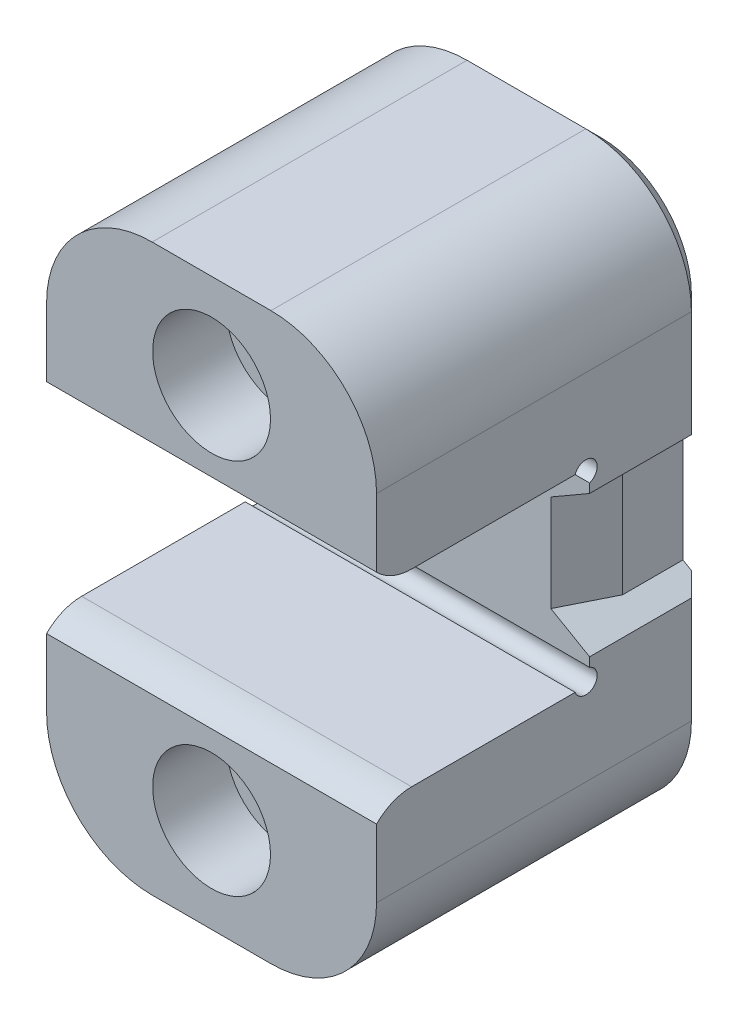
from build123d import *

# Parameters (mm, degrees)
EXTRUDE1_DEPTH                                 = 11.1125
FILLET1_R                                      = 7.112
CUT_EXTRUDE1_DEPTH                             = 37.753282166
CUT_EXTRUDE2_DEPTH                             = 37.753282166
SKETCH6_R                                      = 0.762
CUT_EXTRUDE3_DEPTH                             = 37.753282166
CBORE_FOR_8_SOCKET_HEAD_CAP_SCREW1_D           = 3.81
CBORE_FOR_8_SOCKET_HEAD_CAP_SCREW1_CBORE_D     = 7.9375
CBORE_FOR_8_SOCKET_HEAD_CAP_SCREW1_CBORE_DEPTH = 4.96062
F_10_32_TAPPED_HOLE1_D                         = 4.0386
CHAMFER3_SIZE                                  = 3.81
CHAMFER3_SIZE2                                 = 1.020886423
CHAMFER1_SIZE                                  = 1.016


with BuildPart() as part:
    # Sketch1 → Extrude1 (new, symmetric)
    with BuildSketch(Plane(origin=(0, 0, 0), x_dir=(0, 0, -1), z_dir=(1, 0, 0))):
        Polygon((0, 6.35), (14.351, 6.35), (14.351, -6.35), (0, -6.35), (0, -19.05), (22.225, -19.05), (22.225, 19.05), (0, 19.05), align=None)
    extrude(amount=EXTRUDE1_DEPTH, both=True)

    # Fillet1
    fillet1_edges = [part.edges().sort_by_distance(p)[0] for p in [
        (11.1125, -19.05, -11.1125),
        (11.1125, 19.05, -11.1125),
        (-11.1125, 19.05, -11.1125),
        (-11.1125, -19.05, -11.1125),
    ]]
    fillet(fillet1_edges, radius=FILLET1_R)

    # Sketch2 → Cut-Extrude1 (cut, through all)
    with BuildSketch(Plane(origin=(-11.1125, 0, -22.225), x_dir=(1, 0, 0), z_dir=(0, 0, 1))):
        Polygon((20.6375, 3.845956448), (23.8125, 5.679043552), (23.8125, -5.679043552), (20.6375, -3.845956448), align=None)
    extrude(amount=CUT_EXTRUDE1_DEPTH, mode=Mode.SUBTRACT)

    # Sketch5 → Cut-Extrude2 (cut, through all)
    with BuildSketch(Plane(origin=(11.1125, 0, 0), x_dir=(0, 0, -1), z_dir=(1, 0, 0))):
        with BuildLine():
            Line((-3.9878, -4.171019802), (2.3622, -4.171019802))
            Line((2.3622, -4.171019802), (2.3622, -6.35))
            ThreePointArc((2.3622, -6.35), (1.080400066, -6.60918595), (0, -7.346019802))
            Line((0, -7.346019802), (-3.9878, -7.346019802))
            Line((-3.9878, -7.346019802), (-3.9878, -4.171019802))
        make_face()
        with BuildLine():
            Line((2.3622, 4.171019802), (2.3622, 6.35))
            ThreePointArc((2.3622, 6.35), (1.080400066, 6.60918595), (0, 7.346019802))
            Line((0, 7.346019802), (-3.9878, 7.346019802))
            Line((-3.9878, 7.346019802), (-3.9878, 4.171019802))
            Line((-3.9878, 4.171019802), (2.3622, 4.171019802))
        make_face()
    extrude(amount=-CUT_EXTRUDE2_DEPTH, mode=Mode.SUBTRACT)

    # Sketch6 → Cut-Extrude3 (cut, through all)
    with BuildSketch(Plane(origin=(11.1125, 0, 0), x_dir=(0, 0, -1), z_dir=(1, 0, 0))):
        with Locations((14.097, 6.096)):
            Circle(SKETCH6_R)
        with Locations((14.097, -6.096)):
            Circle(SKETCH6_R)
    extrude(amount=-CUT_EXTRUDE3_DEPTH, mode=Mode.SUBTRACT)

    # CBORE for _8 Socket Head Cap Screw1 (through all)
    with Locations(Plane.XY):
        with Locations((0, 12.7), (0, -12.7)):
            CounterBoreHole(CBORE_FOR_8_SOCKET_HEAD_CAP_SCREW1_D / 2, CBORE_FOR_8_SOCKET_HEAD_CAP_SCREW1_CBORE_D / 2, CBORE_FOR_8_SOCKET_HEAD_CAP_SCREW1_CBORE_DEPTH)

    # 10-32 Tapped Hole1 (through all)
    with Locations(Plane.XY.offset(-4.96062)):
        with Locations((0, 12.7), (0, -12.7)):
            Hole(F_10_32_TAPPED_HOLE1_D / 2)

    # Chamfer3
    chamfer3_edges = [part.edges().sort_by_distance(p)[0] for p in [
        (9.525, 0, -14.351),
    ]]
    chamfer3_side = [part.faces().sort_by_distance(p)[0] for p in [
        (9.525, 0, -18.288),
    ]]
    chamfer(chamfer3_edges, length=CHAMFER3_SIZE, length2=CHAMFER3_SIZE2, reference=chamfer3_side[0])

    # Chamfer1
    chamfer1_edges = [part.edges().sort_by_distance(p)[0] for p in [
        (11.1125, -8.35025, -22.225),
        (-11.1125, 0, -22.225),
        (0, 19.05, -22.225),
        (0, -19.05, -22.225),
        (-9.029443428, 16.966943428, -22.225),
        (-9.029443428, -16.966943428, -22.225),
        (9.029443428, 16.966943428, -22.225),
        (9.029443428, -16.966943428, -22.225),
        (11.1125, 8.35025, -22.225),
    ]]
    chamfer(chamfer1_edges, length=CHAMFER1_SIZE)


solid = part.part
